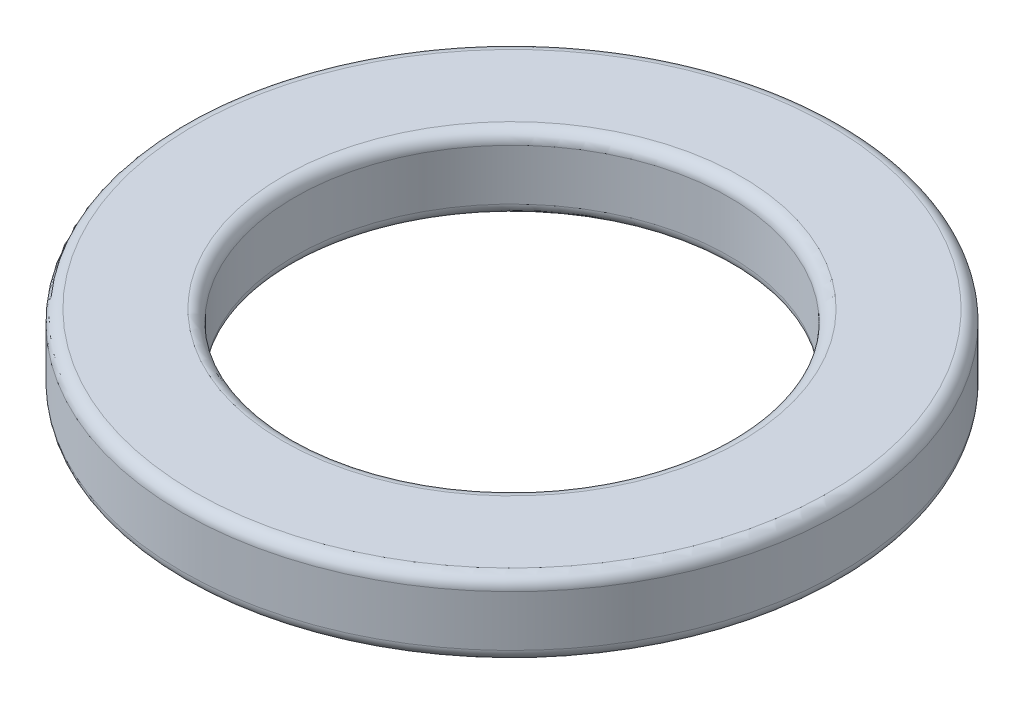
from build123d import *


with BuildPart() as part:
    # Esquisse1 → Base-R_volution (revolve)
    with BuildSketch(Plane.XY, mode=Mode.PRIVATE) as base_r_volution_sk:
        with BuildLine():
            Line((7.65, 0), (10.6, 0))
            ThreePointArc((10.6, 0), (10.882842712, 0.117157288), (11, 0.4))
            Line((11, 0.4), (11, 2.1))
            ThreePointArc((11, 2.1), (10.882842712, 2.382842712), (10.6, 2.5))
            Line((10.6, 2.5), (7.65, 2.5))
            ThreePointArc((7.65, 2.5), (7.367157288, 2.382842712), (7.25, 2.1))
            Line((7.25, 2.1), (7.25, 0.4))
            ThreePointArc((7.25, 0.4), (7.367157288, 0.117157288), (7.65, 0))
        make_face()
    revolve(base_r_volution_sk.sketch.rotate(Axis((0, 15.788926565, 0), (0, -1, 0)), 90), axis=Axis((0, 15.788926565, 0), (0, -1, 0)))


solid = part.part
